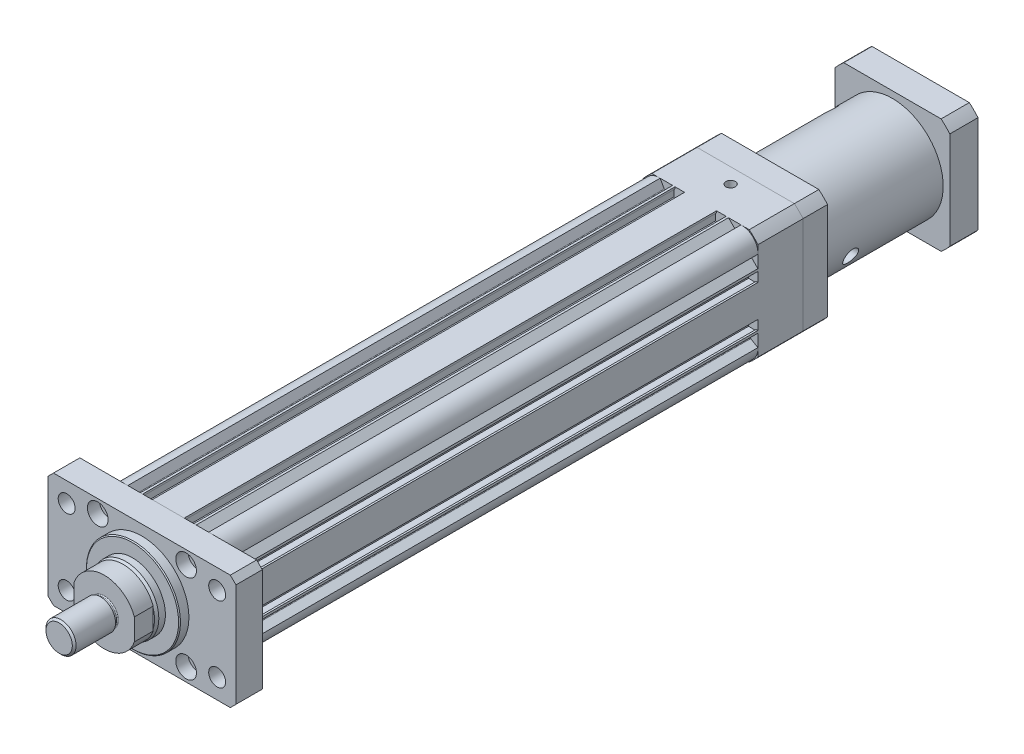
from build123d import *

# Parameters (mm, degrees)
SKETCH_1_R           = 25
SKETCH_1_R_2         = 2.594
EXTRUDE_1_DEPTH      = 283
EXTRUDE_1_2_DEPTH    = 14
SKETCH_3_R           = 4.5
SKETCH_3_R_2         = 3.5
CUT_EXTRUDE_3_DEPTH  = 14
SKETCH_3_5_R         = 5.5
CUT_EXTRUDE_4_DEPTH  = 6.5
SKETCH_5_R           = 25
EXTRUDE_2_DEPTH      = 5
CHAMFER_1_SIZE       = 0.5
SKETCH_6_R           = 17.5
EXTRUDE_3_DEPTH      = 5
CHAMFER_2_SIZE       = 1.5
CHAMFER_2_SIZE2      = 0.8
EXTRUDE_4_DEPTH      = 10
SKETCH_8_R           = 7
EXTRUDE_5_DEPTH      = 2
SKETCH_9_R           = 8
EXTRUDE_6_DEPTH      = 22
CHAMFER_3_SIZE       = 1
FILLET_1_R           = 0.5
SKETCH_10_W          = 61
SKETCH_10_H          = 61
EXTRUDE_7_DEPTH      = 24
SKETCH_11_R          = 50
SKETCH_11_R_2        = 40
CUT_EXTRUDE_1_DEPTH  = 24
SKETCH_16_W          = 61
SKETCH_16_H          = 61
EXTRUDE_8_DEPTH      = 13
SKETCH_18_R          = 3.5
CUT_EXTRUDE_5_DEPTH  = 13
SKETCH_19_R          = 27
EXTRUDE_9_DEPTH      = 65
SKETCH_20_W          = 61
SKETCH_20_H          = 61
EXTRUDE_10_DEPTH     = 15
SKETCH_21_R          = 2.5
CUT_EXTRUDE_6_DEPTH  = 10
SKETCH_22_R          = 50
SKETCH_22_R_2        = 40
CUT_EXTRUDE_2_DEPTH  = 93
SKETCH_23_R          = 21
CUT_EXTRUDE_7_DEPTH  = 80
SKETCH_23_3_R        = 25
CUT_EXTRUDE_8_DEPTH  = 7
SKETCH_24_R          = 4
CUT_EXTRUDE_9_DEPTH  = 27
SKETCH_25_R          = 4
CUT_EXTRUDE_10_DEPTH = 27


with BuildPart() as part:
    # Sketch 1 → Extrude 1 (new body)
    with BuildSketch(Plane.XY):
        with BuildLine():
            Line((30.5, 8.5), (29.5, 8.5))
            Line((29.5, 8.5), (29.5, 7.9))
            Line((29.5, 7.9), (25.5, 7.9))
            Line((25.5, 7.9), (25.5, 14.2))
            Line((25.5, 14.2), (29.5, 14.2))
            Line((29.5, 14.2), (29.5, 13.6))
            Line((29.5, 13.6), (30.5, 13.6))
            Line((30.5, 13.6), (30.5, 14.843551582))
            Line((30.5, 14.843551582), (26.602512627, 18.741038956))
            ThreePointArc((26.602512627, 18.741038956), (26.502994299, 19.034210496), (26.675, 19.29163522))
            Line((26.675, 19.29163522), (30.5, 21.5))
            ThreePointArc((30.5, 21.5), (28.010599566, 28.010599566), (21.5, 30.5))
            Line((21.5, 30.5), (19.29163522, 26.675))
            ThreePointArc((19.29163522, 26.675), (19.034210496, 26.502994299), (18.741038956, 26.602512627))
            Line((18.741038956, 26.602512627), (14.843551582, 30.5))
            Line((14.843551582, 30.5), (13.6, 30.5))
            Line((13.6, 30.5), (13.6, 29.5))
            Line((13.6, 29.5), (14.2, 29.5))
            Line((14.2, 29.5), (14.2, 25.5))
            Line((14.2, 25.5), (7.9, 25.5))
            Line((7.9, 25.5), (7.9, 29.5))
            Line((7.9, 29.5), (8.5, 29.5))
            Line((8.5, 29.5), (8.5, 30.5))
            Line((8.5, 30.5), (-8.5, 30.5))
            Line((-8.5, 30.5), (-8.5, 29.5))
            Line((-8.5, 29.5), (-7.9, 29.5))
            Line((-7.9, 29.5), (-7.9, 25.5))
            Line((-7.9, 25.5), (-14.2, 25.5))
            Line((-14.2, 25.5), (-14.2, 29.5))
            Line((-14.2, 29.5), (-13.6, 29.5))
            Line((-13.6, 29.5), (-13.6, 30.5))
            Line((-13.6, 30.5), (-14.843551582, 30.5))
            Line((-14.843551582, 30.5), (-18.741038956, 26.602512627))
            ThreePointArc((-18.741038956, 26.602512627), (-19.034210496, 26.502994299), (-19.29163522, 26.675))
            Line((-19.29163522, 26.675), (-21.5, 30.5))
            ThreePointArc((-21.5, 30.5), (-28.010599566, 28.010599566), (-30.5, 21.5))
            Line((-30.5, 21.5), (-26.675, 19.29163522))
            ThreePointArc((-26.675, 19.29163522), (-26.502994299, 19.034210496), (-26.602512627, 18.741038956))
            Line((-26.602512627, 18.741038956), (-30.5, 14.843551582))
            Line((-30.5, 14.843551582), (-30.5, 13.6))
            Line((-30.5, 13.6), (-29.5, 13.6))
            Line((-29.5, 13.6), (-29.5, 14.2))
            Line((-29.5, 14.2), (-25.5, 14.2))
            Line((-25.5, 14.2), (-25.5, 7.9))
            Line((-25.5, 7.9), (-29.5, 7.9))
            Line((-29.5, 7.9), (-29.5, 8.5))
            Line((-29.5, 8.5), (-30.5, 8.5))
            Line((-30.5, 8.5), (-30.5, -8.5))
            Line((-30.5, -8.5), (-29.5, -8.5))
            Line((-29.5, -8.5), (-29.5, -7.9))
            Line((-29.5, -7.9), (-25.5, -7.9))
            Line((-25.5, -7.9), (-25.5, -14.2))
            Line((-25.5, -14.2), (-29.5, -14.2))
            Line((-29.5, -14.2), (-29.5, -13.6))
            Line((-29.5, -13.6), (-30.5, -13.6))
            Line((-30.5, -13.6), (-30.5, -14.843551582))
            Line((-30.5, -14.843551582), (-26.602512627, -18.741038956))
            ThreePointArc((-26.602512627, -18.741038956), (-26.502994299, -19.034210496), (-26.675, -19.29163522))
            Line((-26.675, -19.29163522), (-30.5, -21.5))
            ThreePointArc((-30.5, -21.5), (-27.825897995, -28.191225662), (-21, -30.5))
            Line((-21, -30.5), (-18.79163522, -26.675))
            ThreePointArc((-18.79163522, -26.675), (-18.534210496, -26.502994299), (-18.241038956, -26.602512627))
            Line((-18.241038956, -26.602512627), (-14.343551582, -30.5))
            Line((-14.343551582, -30.5), (14.343551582, -30.5))
            Line((14.343551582, -30.5), (18.241038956, -26.602512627))
            ThreePointArc((18.241038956, -26.602512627), (18.534210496, -26.502994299), (18.79163522, -26.675))
            Line((18.79163522, -26.675), (21, -30.5))
            ThreePointArc((21, -30.5), (27.825897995, -28.191225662), (30.5, -21.5))
            Line((30.5, -21.5), (26.675, -19.29163522))
            ThreePointArc((26.675, -19.29163522), (26.502994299, -19.034210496), (26.602512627, -18.741038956))
            Line((26.602512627, -18.741038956), (30.5, -14.843551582))
            Line((30.5, -14.843551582), (30.5, -13.6))
            Line((30.5, -13.6), (29.5, -13.6))
            Line((29.5, -13.6), (29.5, -14.2))
            Line((29.5, -14.2), (25.5, -14.2))
            Line((25.5, -14.2), (25.5, -7.9))
            Line((25.5, -7.9), (29.5, -7.9))
            Line((29.5, -7.9), (29.5, -8.5))
            Line((29.5, -8.5), (30.5, -8.5))
            Line((30.5, -8.5), (30.5, 8.5))
        make_face()
        Circle(SKETCH_1_R, mode=Mode.SUBTRACT)
        with Locations((23.5, -23.5)):
            Circle(SKETCH_1_R_2, mode=Mode.SUBTRACT)
        with Locations((-23.5, -23.5)):
            Circle(SKETCH_1_R_2, mode=Mode.SUBTRACT)
        with Locations((23.5, 23.5)):
            Circle(SKETCH_1_R_2, mode=Mode.SUBTRACT)
        with Locations((-23.5, 23.5)):
            Circle(SKETCH_1_R_2, mode=Mode.SUBTRACT)
        with BuildLine():
            Line((-14.843484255, -26.551505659), (-5.699422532, -26.551505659))
            ThreePointArc((-5.699422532, -26.551505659), (-5.401016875, -26.282393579), (-5.637974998, -25.957866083))
            ThreePointArc((-5.637974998, -25.957866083), (-10.496775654, -24.470016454), (-15.006657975, -22.128520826))
            ThreePointArc((-15.006657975, -22.128520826), (-15.31244973, -22.117932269), (-15.468484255, -22.381131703))
            Line((-15.468484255, -22.381131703), (-15.468484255, -25.926505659))
            Line((-15.468484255, -25.926505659), (-14.843484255, -26.551505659))
        make_face(mode=Mode.SUBTRACT)
        with BuildLine():
            Line((15.037740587, -26.551505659), (5.893678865, -26.551505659))
            ThreePointArc((5.893678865, -26.551505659), (5.595273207, -26.282393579), (5.832231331, -25.957866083))
            ThreePointArc((5.832231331, -25.957866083), (10.691031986, -24.470016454), (15.200914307, -22.128520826))
            ThreePointArc((15.200914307, -22.128520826), (15.506706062, -22.117932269), (15.662740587, -22.381131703))
            Line((15.662740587, -22.381131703), (15.662740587, -25.926505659))
            Line((15.662740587, -25.926505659), (15.037740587, -26.551505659))
        make_face(mode=Mode.SUBTRACT)
        with BuildLine():
            Line((24.057261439, -13.884764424), (23.358946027, -13.481591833))
            ThreePointArc((23.358946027, -13.481591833), (23.055418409, -13.441631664), (22.812535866, -13.628001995))
            Line((22.812535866, -13.628001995), (21.480305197, -15.935493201))
            ThreePointArc((21.480305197, -15.935493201), (21.440345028, -16.239020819), (21.626715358, -16.481903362))
            Line((21.626715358, -16.481903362), (22.892186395, -17.212523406))
            ThreePointArc((22.892186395, -17.212523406), (23.195714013, -17.252483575), (23.438596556, -17.066113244))
            Line((23.438596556, -17.066113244), (24.274264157, -15.618694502))
            ThreePointArc((24.274264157, -15.618694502), (24.317966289, -15.507082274), (24.326638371, -15.387533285))
            Line((24.326638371, -15.387533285), (24.223757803, -14.070923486))
            ThreePointArc((24.223757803, -14.070923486), (24.155411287, -13.964516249), (24.057261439, -13.884764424))
        make_face(mode=Mode.SUBTRACT)
        with BuildLine():
            Line((-24.057261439, -13.884764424), (-23.358946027, -13.481591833))
            ThreePointArc((-23.358946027, -13.481591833), (-23.055418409, -13.441631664), (-22.812535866, -13.628001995))
            Line((-22.812535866, -13.628001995), (-21.480305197, -15.935493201))
            ThreePointArc((-21.480305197, -15.935493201), (-21.440345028, -16.239020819), (-21.626715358, -16.481903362))
            Line((-21.626715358, -16.481903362), (-22.892186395, -17.212523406))
            ThreePointArc((-22.892186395, -17.212523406), (-23.195714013, -17.252483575), (-23.438596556, -17.066113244))
            Line((-23.438596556, -17.066113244), (-24.274264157, -15.618694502))
            ThreePointArc((-24.274264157, -15.618694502), (-24.317966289, -15.507082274), (-24.326638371, -15.387533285))
            Line((-24.326638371, -15.387533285), (-24.223757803, -14.070923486))
            ThreePointArc((-24.223757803, -14.070923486), (-24.155411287, -13.964516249), (-24.057261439, -13.884764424))
        make_face(mode=Mode.SUBTRACT)
        with BuildLine():
            Line((24.057261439, 13.884764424), (23.358946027, 13.481591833))
            ThreePointArc((23.358946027, 13.481591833), (23.055418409, 13.441631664), (22.812535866, 13.628001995))
            Line((22.812535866, 13.628001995), (21.480305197, 15.935493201))
            ThreePointArc((21.480305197, 15.935493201), (21.440345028, 16.239020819), (21.626715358, 16.481903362))
            Line((21.626715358, 16.481903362), (22.892186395, 17.212523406))
            ThreePointArc((22.892186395, 17.212523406), (23.195714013, 17.252483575), (23.438596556, 17.066113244))
            Line((23.438596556, 17.066113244), (24.274264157, 15.618694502))
            ThreePointArc((24.274264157, 15.618694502), (24.317966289, 15.507082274), (24.326638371, 15.387533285))
            Line((24.326638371, 15.387533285), (24.223757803, 14.070923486))
            ThreePointArc((24.223757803, 14.070923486), (24.155411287, 13.964516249), (24.057261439, 13.884764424))
        make_face(mode=Mode.SUBTRACT)
        with BuildLine():
            Line((-24.057261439, 13.884764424), (-23.358946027, 13.481591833))
            ThreePointArc((-23.358946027, 13.481591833), (-23.055418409, 13.441631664), (-22.812535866, 13.628001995))
            Line((-22.812535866, 13.628001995), (-21.480305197, 15.935493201))
            ThreePointArc((-21.480305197, 15.935493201), (-21.440345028, 16.239020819), (-21.626715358, 16.481903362))
            Line((-21.626715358, 16.481903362), (-22.892186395, 17.212523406))
            ThreePointArc((-22.892186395, 17.212523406), (-23.195714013, 17.252483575), (-23.438596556, 17.066113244))
            Line((-23.438596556, 17.066113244), (-24.274264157, 15.618694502))
            ThreePointArc((-24.274264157, 15.618694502), (-24.317966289, 15.507082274), (-24.326638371, 15.387533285))
            Line((-24.326638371, 15.387533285), (-24.223757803, 14.070923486))
            ThreePointArc((-24.223757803, 14.070923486), (-24.155411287, 13.964516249), (-24.057261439, 13.884764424))
        make_face(mode=Mode.SUBTRACT)
        with BuildLine():
            Line((17.761634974, 23.75411276), (17.07315308, 24.68624059))
            ThreePointArc((17.07315308, 24.68624059), (16.934629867, 24.812286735), (16.758415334, 24.87572765))
            Line((16.758415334, 24.87572765), (13.966108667, 25.295529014))
            ThreePointArc((13.966108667, 25.295529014), (13.689318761, 25.25468305), (13.482325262, 25.066441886))
            Line((13.482325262, 25.066441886), (12.839111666, 23.986237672))
            ThreePointArc((12.839111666, 23.986237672), (12.785382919, 23.626185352), (12.999780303, 23.331977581))
            ThreePointArc((12.999780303, 23.331977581), (14.833000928, 22.112125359), (16.576342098, 20.766949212))
            ThreePointArc((16.576342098, 20.766949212), (17.053890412, 20.688035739), (17.357364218, 21.065107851))
            Line((17.357364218, 21.065107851), (17.761634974, 23.75411276))
        make_face(mode=Mode.SUBTRACT)
        with BuildLine():
            Line((-17.761634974, 23.75411276), (-17.07315308, 24.68624059))
            ThreePointArc((-17.07315308, 24.68624059), (-16.934629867, 24.812286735), (-16.758415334, 24.87572765))
            Line((-16.758415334, 24.87572765), (-13.966108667, 25.295529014))
            ThreePointArc((-13.966108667, 25.295529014), (-13.689318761, 25.25468305), (-13.482325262, 25.066441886))
            Line((-13.482325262, 25.066441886), (-12.839111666, 23.986237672))
            ThreePointArc((-12.839111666, 23.986237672), (-12.785382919, 23.626185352), (-12.999780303, 23.331977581))
            ThreePointArc((-12.999780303, 23.331977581), (-14.833000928, 22.112125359), (-16.576342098, 20.766949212))
            ThreePointArc((-16.576342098, 20.766949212), (-17.053890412, 20.688035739), (-17.357364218, 21.065107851))
            Line((-17.357364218, 21.065107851), (-17.761634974, 23.75411276))
        make_face(mode=Mode.SUBTRACT)
    extrude(amount=EXTRUDE_1_DEPTH)

    # Sketch 10 → Extrude 7 (add)
    with BuildSketch(Plane(origin=(0, 0, 0), x_dir=(-1, 0, 0), z_dir=(0, 0, -1))):
        Rectangle(SKETCH_10_W, SKETCH_10_H)
    extrude(amount=EXTRUDE_7_DEPTH)

    # Sketch 11 → Cut-Extrude 1 (cut)
    with BuildSketch(Plane(origin=(0, 0, -24), x_dir=(-1, 0, 0), z_dir=(0, 0, -1))):
        Circle(SKETCH_11_R)
        Circle(SKETCH_11_R_2, mode=Mode.SUBTRACT)
    extrude(amount=-CUT_EXTRUDE_1_DEPTH, mode=Mode.SUBTRACT)

    # Sketch 15 → Hole Wizard M6 _1 (revolve, cut)
    with BuildSketch(Plane(origin=(0, 30.5, -16), x_dir=(0, 0, 1), z_dir=(1, 0, 0))):
        Polygon((0, 0), (0, 9.502151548), (2.5, 8), (2.5, 0), align=None)
    revolve(axis=Axis((0, 36.85, -16), (0, -1, 0)), mode=Mode.SUBTRACT)


with BuildPart() as body_2:
    # Sketch 2 → Extrude 1 2 (new body)
    with BuildSketch(Plane.XY.offset(283)):
        Polygon((-47, 30.5), (-50, 27.5), (-50, -27.5), (-47, -30.5), (47, -30.5), (50, -27.5), (50, 27.5), (47, 30.5), align=None)
    extrude(amount=EXTRUDE_1_2_DEPTH)

    # Sketch 3 → Cut-Extrude 3 (cut)
    with BuildSketch(Plane.XY.offset(297)):
        with Locations((-40, -20)):
            Circle(SKETCH_3_R)
        with Locations((-23.5, -23.5)):
            Circle(SKETCH_3_R_2)
        with Locations((-23.5, 23.5)):
            Circle(SKETCH_3_R_2)
        with Locations((23.5, 23.5)):
            Circle(SKETCH_3_R_2)
        with Locations((40, 20)):
            Circle(SKETCH_3_R)
        with Locations((40, -20)):
            Circle(SKETCH_3_R)
        with Locations((23.5, -23.5)):
            Circle(SKETCH_3_R_2)
        with Locations((-40, 20)):
            Circle(SKETCH_3_R)
    extrude(amount=-CUT_EXTRUDE_3_DEPTH, mode=Mode.SUBTRACT)

    # Sketch 3_5 → Cut-Extrude 4 (cut)
    with BuildSketch(Plane.XY.offset(297)):
        with Locations((-23.5, 23.5)):
            Circle(SKETCH_3_5_R)
        with Locations((-23.5, -23.5)):
            Circle(SKETCH_3_5_R)
        with Locations((23.5, -23.5)):
            Circle(SKETCH_3_5_R)
        with Locations((23.5, 23.5)):
            Circle(SKETCH_3_5_R)
    extrude(amount=-CUT_EXTRUDE_4_DEPTH, mode=Mode.SUBTRACT)

    # Sketch 5 → Extrude 2 (add)
    with BuildSketch(Plane.XY.offset(297)):
        Circle(SKETCH_5_R)
    extrude(amount=EXTRUDE_2_DEPTH)

    # Chamfer 1
    chamfer_1_edges = [body_2.edges().sort_by_distance(p)[0] for p in [
        (-25, 0, 302),
    ]]
    chamfer(chamfer_1_edges, length=CHAMFER_1_SIZE)

    # Sketch 6 → Extrude 3 (add)
    with BuildSketch(Plane.XY.offset(302)):
        Circle(SKETCH_6_R)
    extrude(amount=EXTRUDE_3_DEPTH)

    # Chamfer 2
    chamfer_2_edges = [body_2.edges().sort_by_distance(p)[0] for p in [
        (-17.5, 0, 307),
    ]]
    chamfer_2_side = [body_2.faces().sort_by_distance(p)[0] for p in [
        (-17.5, 0, 304.5),
    ]]
    chamfer(chamfer_2_edges, length=CHAMFER_2_SIZE, length2=CHAMFER_2_SIZE2, reference=chamfer_2_side[0])

    # Sketch 7 → Extrude 4 (add)
    with BuildSketch(Plane.XY.offset(307)):
        with BuildLine():
            Line((-16, 5.744562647), (-16, -5.744562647))
            ThreePointArc((-16, -5.744562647), (0, -17), (16, -5.744562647))
            Line((16, -5.744562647), (16, 5.744562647))
            ThreePointArc((16, 5.744562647), (0, 17), (-16, 5.744562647))
        make_face()
    extrude(amount=EXTRUDE_4_DEPTH)

    # Sketch 8 → Extrude 5 (add)
    with BuildSketch(Plane.XY.offset(317)):
        Circle(SKETCH_8_R)
    extrude(amount=EXTRUDE_5_DEPTH)

    # Sketch 9 → Extrude 6 (add)
    with BuildSketch(Plane.XY.offset(319)):
        Circle(SKETCH_9_R)
    extrude(amount=EXTRUDE_6_DEPTH)

    # Chamfer 3
    chamfer_3_edges = [body_2.edges().sort_by_distance(p)[0] for p in [
        (-8, 0, 341),
    ]]
    chamfer(chamfer_3_edges, length=CHAMFER_3_SIZE)

    # Fillet 1
    fillet_1_edges = [body_2.edges().sort_by_distance(p)[0] for p in [
        (-7, 0, 317),
    ]]
    fillet(fillet_1_edges, radius=FILLET_1_R)


with BuildPart() as body_3:
    # Sketch 16 → Extrude 8 (new body)
    with BuildSketch(Plane(origin=(0, 0, -24), x_dir=(-1, 0, 0), z_dir=(0, 0, -1))):
        Rectangle(SKETCH_16_W, SKETCH_16_H)
    extrude(amount=EXTRUDE_8_DEPTH)

    # Sketch 18 → Cut-Extrude 5 (cut)
    with BuildSketch(Plane(origin=(0, 0, -37), x_dir=(-1, 0, 0), z_dir=(0, 0, -1))):
        with Locations((-23.5, 23.5)):
            Circle(SKETCH_18_R)
        with Locations((-23.5, -23.5)):
            Circle(SKETCH_18_R)
        with Locations((23.5, -23.5)):
            Circle(SKETCH_18_R)
        with Locations((23.5, 23.5)):
            Circle(SKETCH_18_R)
    extrude(amount=-CUT_EXTRUDE_5_DEPTH, mode=Mode.SUBTRACT)

    # Sketch 19 → Extrude 9 (add)
    with BuildSketch(Plane(origin=(0, 0, -37), x_dir=(-1, 0, 0), z_dir=(0, 0, -1))):
        Circle(SKETCH_19_R)
    extrude(amount=EXTRUDE_9_DEPTH)

    # Sketch 20 → Extrude 10 (add)
    with BuildSketch(Plane(origin=(0, 0, -102), x_dir=(-1, 0, 0), z_dir=(0, 0, -1))):
        Rectangle(SKETCH_20_W, SKETCH_20_H)
    extrude(amount=EXTRUDE_10_DEPTH)

    # Sketch 21 → Cut-Extrude 6 (cut)
    with BuildSketch(Plane(origin=(0, 0, -117), x_dir=(-1, 0, 0), z_dir=(0, 0, -1))):
        with Locations((-24.748737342, 24.748737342)):
            Circle(SKETCH_21_R)
        with Locations((24.748737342, 24.748737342)):
            Circle(SKETCH_21_R)
        with Locations((24.748737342, -24.748737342)):
            Circle(SKETCH_21_R)
        with Locations((-24.748737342, -24.748737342)):
            Circle(SKETCH_21_R)
    extrude(amount=-CUT_EXTRUDE_6_DEPTH, mode=Mode.SUBTRACT)

    # Sketch 22 → Cut-Extrude 2 (cut)
    with BuildSketch(Plane(origin=(0, 0, -117), x_dir=(-1, 0, 0), z_dir=(0, 0, -1))):
        Circle(SKETCH_22_R)
        Circle(SKETCH_22_R_2, mode=Mode.SUBTRACT)
    extrude(amount=-CUT_EXTRUDE_2_DEPTH, mode=Mode.SUBTRACT)

    # Sketch 23 → Cut-Extrude 7 (cut)
    with BuildSketch(Plane(origin=(0, 0, -117), x_dir=(-1, 0, 0), z_dir=(0, 0, -1))):
        Circle(SKETCH_23_R)
    extrude(amount=-CUT_EXTRUDE_7_DEPTH, mode=Mode.SUBTRACT)

    # Sketch 23_3 → Cut-Extrude 8 (cut)
    with BuildSketch(Plane(origin=(0, 0, -117), x_dir=(-1, 0, 0), z_dir=(0, 0, -1))):
        Circle(SKETCH_23_3_R)
    extrude(amount=-CUT_EXTRUDE_8_DEPTH, mode=Mode.SUBTRACT)

    # Sketch 24 → Cut-Extrude 9 (cut)
    with BuildSketch(Plane.ZY.offset(30.5)):
        with Locations(Location((-88.78323725, 17.446251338, 0), (0, 0, 270))):
            Circle(SKETCH_24_R)
    extrude(amount=-CUT_EXTRUDE_9_DEPTH, mode=Mode.SUBTRACT)

    # Sketch 25 → Cut-Extrude 10 (cut)
    with BuildSketch(Plane(origin=(30.5, 0, 0), x_dir=(0, 0, -1), z_dir=(1, 0, 0))):
        with Locations((54.542092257, -9.414024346)):
            Circle(SKETCH_25_R)
    extrude(amount=-CUT_EXTRUDE_10_DEPTH, mode=Mode.SUBTRACT)


solid = Compound([part.part, body_2.part, body_3.part])
